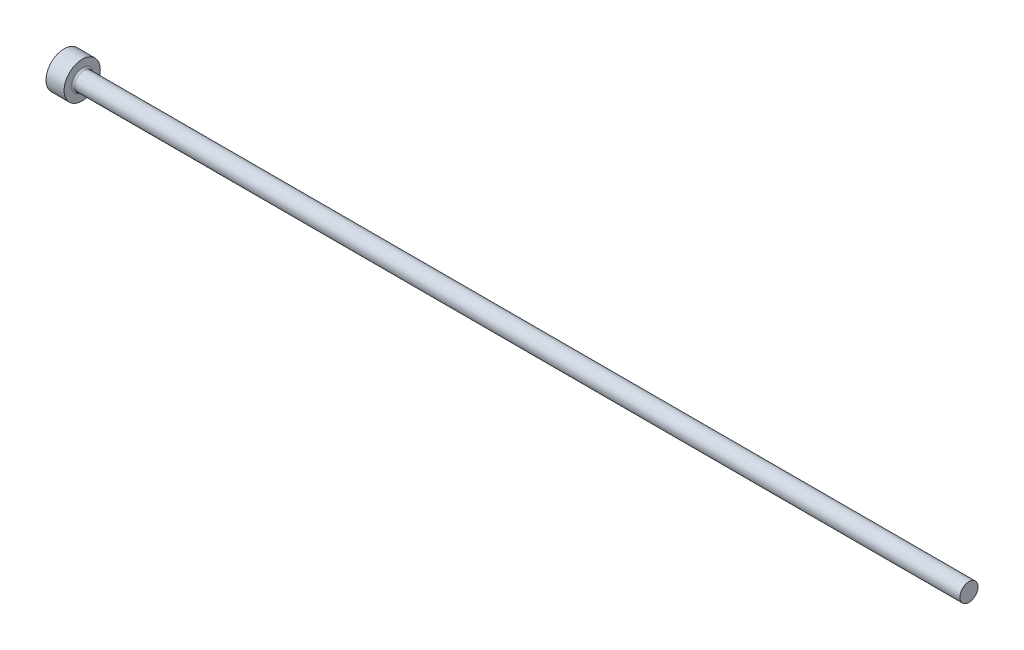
ISO-10303-21;
HEADER;
FILE_DESCRIPTION(('STEP AP214'),'2;1');
FILE_NAME('part.step','',(''),(''),'','','');
FILE_SCHEMA(('AUTOMOTIVE_DESIGN { 1 0 10303 214 1 1 1 1 }'));
ENDSEC;
DATA;
#1=APPLICATION_CONTEXT('core data for automotive mechanical design processes');
#2=APPLICATION_PROTOCOL_DEFINITION('international standard','automotive_design',2000,#1);
#3=PRODUCT_CONTEXT('',#1,'mechanical');
#4=PRODUCT('Part','Part','',(#3));
#5=PRODUCT_RELATED_PRODUCT_CATEGORY('part','',(#4));
#6=PRODUCT_DEFINITION_FORMATION('','',#4);
#7=PRODUCT_DEFINITION_CONTEXT('part definition',#1,'design');
#8=PRODUCT_DEFINITION('design','',#6,#7);
#9=PRODUCT_DEFINITION_SHAPE('','',#8);
#10=(LENGTH_UNIT() NAMED_UNIT(*) SI_UNIT(.MILLI.,.METRE.));
#11=(NAMED_UNIT(*) PLANE_ANGLE_UNIT() SI_UNIT($,.RADIAN.));
#12=(NAMED_UNIT(*) SI_UNIT($,.STERADIAN.) SOLID_ANGLE_UNIT());
#13=UNCERTAINTY_MEASURE_WITH_UNIT(LENGTH_MEASURE(1.E-05),#10,'distance_accuracy_value','');
#14=(GEOMETRIC_REPRESENTATION_CONTEXT(3) GLOBAL_UNCERTAINTY_ASSIGNED_CONTEXT((#13)) GLOBAL_UNIT_ASSIGNED_CONTEXT((#10,
#11,#12)) REPRESENTATION_CONTEXT('',''));
#15=CARTESIAN_POINT('',(0.,0.,0.));
#16=DIRECTION('',(0.,0.,1.));
#17=DIRECTION('',(1.,0.,0.));
#18=AXIS2_PLACEMENT_3D('',#15,#16,#17);
#19=CARTESIAN_POINT('',(0.,0.,0.));
#20=DIRECTION('',(-1.,0.,0.));
#21=DIRECTION('',(0.,-1.,0.));
#22=AXIS2_PLACEMENT_3D('',#19,#20,#21);
#23=PLANE('',#22);
#24=CARTESIAN_POINT('',(0.,0.,0.));
#25=DIRECTION('',(1.,0.,0.));
#26=DIRECTION('',(0.,1.,0.));
#27=AXIS2_PLACEMENT_3D('',#24,#25,#26);
#28=CIRCLE('',#27,2.);
#29=CARTESIAN_POINT('',(0.,2.,0.));
#30=VERTEX_POINT('',#29);
#31=EDGE_CURVE('E25',#30,#30,#28,.T.);
#32=ORIENTED_EDGE('',*,*,#31,.F.);
#33=EDGE_LOOP('',(#32));
#34=FACE_BOUND('',#33,.T.);
#35=ADVANCED_FACE('F14',(#34),#23,.T.);
#36=CARTESIAN_POINT('',(100.,0.,0.));
#37=DIRECTION('',(1.,0.,0.));
#38=DIRECTION('',(0.,1.,0.));
#39=AXIS2_PLACEMENT_3D('',#36,#37,#38);
#40=CYLINDRICAL_SURFACE('',#39,2.);
#41=ORIENTED_EDGE('',*,*,#31,.T.);
#42=EDGE_LOOP('',(#41));
#43=FACE_BOUND('',#42,.T.);
#44=CARTESIAN_POINT('',(2.,0.,0.));
#45=DIRECTION('',(1.,0.,0.));
#46=DIRECTION('',(0.,1.,0.));
#47=AXIS2_PLACEMENT_3D('',#44,#45,#46);
#48=CIRCLE('',#47,2.);
#49=CARTESIAN_POINT('',(2.,2.,0.));
#50=VERTEX_POINT('',#49);
#51=EDGE_CURVE('E29',#50,#50,#48,.T.);
#52=ORIENTED_EDGE('',*,*,#51,.F.);
#53=EDGE_LOOP('',(#52));
#54=FACE_BOUND('',#53,.T.);
#55=ADVANCED_FACE('F51',(#43,#54),#40,.T.);
#56=CARTESIAN_POINT('',(2.,2.,0.));
#57=DIRECTION('',(1.,0.,0.));
#58=DIRECTION('',(0.,1.,0.));
#59=AXIS2_PLACEMENT_3D('',#56,#57,#58);
#60=PLANE('',#59);
#61=CARTESIAN_POINT('',(2.,0.,0.));
#62=DIRECTION('',(1.,0.,0.));
#63=DIRECTION('',(0.,1.,0.));
#64=AXIS2_PLACEMENT_3D('',#61,#62,#63);
#65=CIRCLE('',#64,1.19999999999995);
#66=CARTESIAN_POINT('',(2.,1.19999999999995,0.));
#67=VERTEX_POINT('',#66);
#68=EDGE_CURVE('E9',#67,#67,#65,.F.);
#69=ORIENTED_EDGE('',*,*,#68,.T.);
#70=EDGE_LOOP('',(#69));
#71=FACE_BOUND('',#70,.T.);
#72=ORIENTED_EDGE('',*,*,#51,.T.);
#73=EDGE_LOOP('',(#72));
#74=FACE_BOUND('',#73,.T.);
#75=ADVANCED_FACE('F42',(#71,#74),#60,.T.);
#76=CARTESIAN_POINT('',(100.,0.,0.));
#77=DIRECTION('',(1.,0.,0.));
#78=DIRECTION('',(0.,1.,0.));
#79=AXIS2_PLACEMENT_3D('',#76,#77,#78);
#80=CYLINDRICAL_SURFACE('',#79,0.999999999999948);
#81=CARTESIAN_POINT('',(2.2,0.,0.));
#82=DIRECTION('',(1.,0.,0.));
#83=DIRECTION('',(0.,1.,0.));
#84=AXIS2_PLACEMENT_3D('',#81,#82,#83);
#85=CIRCLE('',#84,0.999999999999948);
#86=CARTESIAN_POINT('',(2.2,0.999999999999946,0.));
#87=VERTEX_POINT('',#86);
#88=EDGE_CURVE('E21',#87,#87,#85,.T.);
#89=ORIENTED_EDGE('',*,*,#88,.T.);
#90=EDGE_LOOP('',(#89));
#91=FACE_BOUND('',#90,.T.);
#92=CARTESIAN_POINT('',(100.,0.,0.));
#93=DIRECTION('',(1.,0.,0.));
#94=DIRECTION('',(0.,1.,0.));
#95=AXIS2_PLACEMENT_3D('',#92,#93,#94);
#96=CIRCLE('',#95,0.999999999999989);
#97=CARTESIAN_POINT('',(100.,0.999999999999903,0.));
#98=VERTEX_POINT('',#97);
#99=EDGE_CURVE('E34',#98,#98,#96,.T.);
#100=ORIENTED_EDGE('',*,*,#99,.F.);
#101=EDGE_LOOP('',(#100));
#102=FACE_BOUND('',#101,.T.);
#103=ADVANCED_FACE('F40',(#91,#102),#80,.T.);
#104=CARTESIAN_POINT('',(100.,0.999999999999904,0.));
#105=DIRECTION('',(1.,0.,0.));
#106=DIRECTION('',(0.,1.,0.));
#107=AXIS2_PLACEMENT_3D('',#104,#105,#106);
#108=PLANE('',#107);
#109=ORIENTED_EDGE('',*,*,#99,.T.);
#110=EDGE_LOOP('',(#109));
#111=FACE_BOUND('',#110,.T.);
#112=ADVANCED_FACE('F38',(#111),#108,.T.);
#113=CARTESIAN_POINT('',(2.2,0.,0.));
#114=DIRECTION('',(1.,0.,0.));
#115=DIRECTION('',(0.,1.,0.));
#116=AXIS2_PLACEMENT_3D('',#113,#114,#115);
#117=TOROIDAL_SURFACE('',#116,1.19999999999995,0.2);
#118=ORIENTED_EDGE('',*,*,#68,.F.);
#119=EDGE_LOOP('',(#118));
#120=FACE_BOUND('',#119,.T.);
#121=ORIENTED_EDGE('',*,*,#88,.F.);
#122=EDGE_LOOP('',(#121));
#123=FACE_BOUND('',#122,.T.);
#124=ADVANCED_FACE('F16',(#120,#123),#117,.F.);
#125=CLOSED_SHELL('',(#35,#55,#75,#103,#112,#124));
#126=MANIFOLD_SOLID_BREP('B1',#125);
#127=ADVANCED_BREP_SHAPE_REPRESENTATION('',(#18,#126),#14);
#128=SHAPE_DEFINITION_REPRESENTATION(#9,#127);
ENDSEC;
END-ISO-10303-21;
